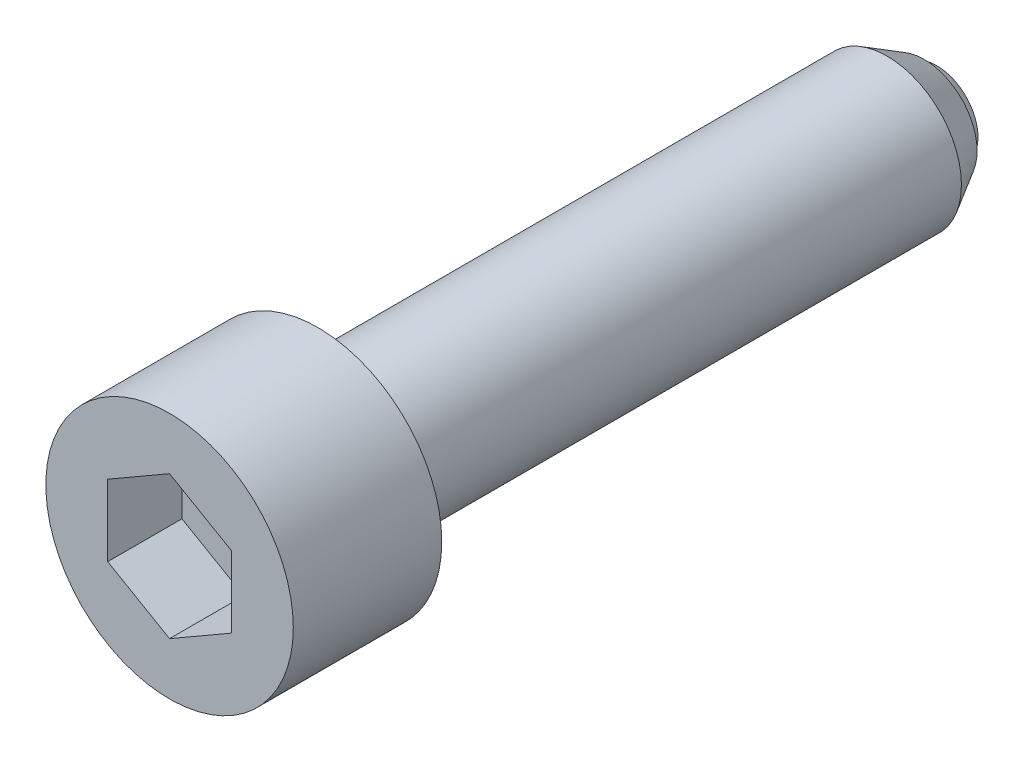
ISO-10303-21;
HEADER;
FILE_DESCRIPTION(('STEP AP214'),'2;1');
FILE_NAME('part.step','',(''),(''),'','','');
FILE_SCHEMA(('AUTOMOTIVE_DESIGN { 1 0 10303 214 1 1 1 1 }'));
ENDSEC;
DATA;
#1=APPLICATION_CONTEXT('core data for automotive mechanical design processes');
#2=APPLICATION_PROTOCOL_DEFINITION('international standard','automotive_design',2000,#1);
#3=PRODUCT_CONTEXT('',#1,'mechanical');
#4=PRODUCT('Part','Part','',(#3));
#5=PRODUCT_RELATED_PRODUCT_CATEGORY('part','',(#4));
#6=PRODUCT_DEFINITION_FORMATION('','',#4);
#7=PRODUCT_DEFINITION_CONTEXT('part definition',#1,'design');
#8=PRODUCT_DEFINITION('design','',#6,#7);
#9=PRODUCT_DEFINITION_SHAPE('','',#8);
#10=(LENGTH_UNIT() NAMED_UNIT(*) SI_UNIT(.MILLI.,.METRE.));
#11=(NAMED_UNIT(*) PLANE_ANGLE_UNIT() SI_UNIT($,.RADIAN.));
#12=(NAMED_UNIT(*) SI_UNIT($,.STERADIAN.) SOLID_ANGLE_UNIT());
#13=UNCERTAINTY_MEASURE_WITH_UNIT(LENGTH_MEASURE(1.E-05),#10,'distance_accuracy_value','');
#14=(GEOMETRIC_REPRESENTATION_CONTEXT(3) GLOBAL_UNCERTAINTY_ASSIGNED_CONTEXT((#13)) GLOBAL_UNIT_ASSIGNED_CONTEXT((#10,
#11,#12)) REPRESENTATION_CONTEXT('',''));
#15=CARTESIAN_POINT('',(0.,0.,0.));
#16=DIRECTION('',(0.,0.,1.));
#17=DIRECTION('',(1.,0.,0.));
#18=AXIS2_PLACEMENT_3D('',#15,#16,#17);
#19=CARTESIAN_POINT('',(0.,0.,1.1));
#20=DIRECTION('',(0.,0.,-1.));
#21=DIRECTION('',(1.,0.,0.));
#22=AXIS2_PLACEMENT_3D('',#19,#20,#21);
#23=SPHERICAL_SURFACE('',#22,2.);
#24=CARTESIAN_POINT('',(0.,0.,0.5));
#25=DIRECTION('',(0.,0.,-1.));
#26=DIRECTION('',(1.,0.,0.));
#27=AXIS2_PLACEMENT_3D('',#24,#25,#26);
#28=CIRCLE('',#27,1.90787840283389);
#29=CARTESIAN_POINT('',(1.90787840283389,0.,0.5));
#30=VERTEX_POINT('',#29);
#31=EDGE_CURVE('E9',#30,#30,#28,.T.);
#32=CARTESIAN_POINT('',(0.,0.,0.));
#33=DIRECTION('',(0.,0.,-1.));
#34=DIRECTION('',(1.,0.,0.));
#35=AXIS2_PLACEMENT_3D('',#32,#33,#34);
#36=CIRCLE('',#35,1.670329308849);
#37=CARTESIAN_POINT('',(1.67032930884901,0.,0.));
#38=VERTEX_POINT('',#37);
#39=EDGE_CURVE('E17',#38,#38,#36,.F.);
#40=CARTESIAN_POINT('',(1.90787840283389,0.,0.5));
#41=CARTESIAN_POINT('',(1.90614295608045,0.,0.494481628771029));
#42=CARTESIAN_POINT('',(1.90438356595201,0.,0.488970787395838));
#43=CARTESIAN_POINT('',(1.90081703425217,0.,0.477964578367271));
#44=CARTESIAN_POINT('',(1.89900989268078,0.,0.472469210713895));
#45=CARTESIAN_POINT('',(1.8953479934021,0.,0.46149436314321));
#46=CARTESIAN_POINT('',(1.89349323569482,0.,0.456014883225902));
#47=CARTESIAN_POINT('',(1.88973624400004,0.,0.445072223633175));
#48=CARTESIAN_POINT('',(1.88783401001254,0.,0.439609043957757));
#49=CARTESIAN_POINT('',(1.8839822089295,0.,0.428699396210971));
#50=CARTESIAN_POINT('',(1.88203264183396,0.,0.423252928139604));
#51=CARTESIAN_POINT('',(1.87808632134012,0.,0.412377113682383));
#52=CARTESIAN_POINT('',(1.87608956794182,0.,0.40694776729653));
#53=CARTESIAN_POINT('',(1.87204902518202,0.,0.396106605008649));
#54=CARTESIAN_POINT('',(1.87000523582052,0.,0.39069478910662));
#55=CARTESIAN_POINT('',(1.86587077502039,0.,0.379889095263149));
#56=CARTESIAN_POINT('',(1.86378010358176,0.,0.374495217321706));
#57=CARTESIAN_POINT('',(1.85955203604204,0.,0.363725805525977));
#58=CARTESIAN_POINT('',(1.85741463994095,0.,0.358350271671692));
#59=CARTESIAN_POINT('',(1.85309328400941,0.,0.347617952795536));
#60=CARTESIAN_POINT('',(1.85090932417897,0.,0.342261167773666));
#61=CARTESIAN_POINT('',(1.84649500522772,0.,0.331566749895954));
#62=CARTESIAN_POINT('',(1.84426464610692,0.,0.326229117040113));
#63=CARTESIAN_POINT('',(1.83975769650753,0.,0.315573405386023));
#64=CARTESIAN_POINT('',(1.83748110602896,0.,0.310255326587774));
#65=CARTESIAN_POINT('',(1.83288186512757,0.,0.299639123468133));
#66=CARTESIAN_POINT('',(1.83055921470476,0.,0.29434099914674));
#67=CARTESIAN_POINT('',(1.82586802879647,0.,0.283765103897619));
#68=CARTESIAN_POINT('',(1.823499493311,0.,0.278487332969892));
#69=CARTESIAN_POINT('',(1.81871671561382,0.,0.267952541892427));
#70=CARTESIAN_POINT('',(1.81630247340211,0.,0.26269552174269));
#71=CARTESIAN_POINT('',(1.81142846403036,0.,0.252202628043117));
#72=CARTESIAN_POINT('',(1.80896869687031,0.,0.246966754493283));
#73=CARTESIAN_POINT('',(1.80400382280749,0.,0.236516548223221));
#74=CARTESIAN_POINT('',(1.80149871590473,0.,0.231302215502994));
#75=CARTESIAN_POINT('',(1.79644335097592,0.,0.220895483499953));
#76=CARTESIAN_POINT('',(1.79389309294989,0.,0.215703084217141));
#77=CARTESIAN_POINT('',(1.78874761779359,0.,0.205340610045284));
#78=CARTESIAN_POINT('',(1.78615240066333,0.,0.200170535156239));
#79=CARTESIAN_POINT('',(1.78091720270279,0.,0.189853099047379));
#80=CARTESIAN_POINT('',(1.77827722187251,0.,0.184705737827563));
#81=CARTESIAN_POINT('',(1.77295269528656,0.,0.174434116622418));
#82=CARTESIAN_POINT('',(1.77026814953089,0.,0.169309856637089));
#83=CARTESIAN_POINT('',(1.76485469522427,0.,0.159084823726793));
#84=CARTESIAN_POINT('',(1.76212578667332,0.,0.153984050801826));
#85=CARTESIAN_POINT('',(1.7566238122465,0.,0.143806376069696));
#86=CARTESIAN_POINT('',(1.75385074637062,0.,0.138729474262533));
#87=CARTESIAN_POINT('',(1.7482606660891,0.,0.128599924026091));
#88=CARTESIAN_POINT('',(1.74544365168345,0.,0.123547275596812));
#89=CARTESIAN_POINT('',(1.73976588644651,0.,0.113466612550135));
#90=CARTESIAN_POINT('',(1.73690513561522,0.,0.108438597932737));
#91=CARTESIAN_POINT('',(1.73114011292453,0.,0.0984075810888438));
#92=CARTESIAN_POINT('',(1.72823584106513,0.,0.0934045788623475));
#93=CARTESIAN_POINT('',(1.72238399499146,0.,0.0834239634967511));
#94=CARTESIAN_POINT('',(1.71943642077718,0.,0.078446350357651));
#95=CARTESIAN_POINT('',(1.71349819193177,0.,0.0685168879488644));
#96=CARTESIAN_POINT('',(1.71050753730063,0.,0.0635650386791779));
#97=CARTESIAN_POINT('',(1.70448337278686,0.,0.0536874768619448));
#98=CARTESIAN_POINT('',(1.70144986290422,0.,0.0487617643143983));
#99=CARTESIAN_POINT('',(1.6953402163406,0.,0.0389368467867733));
#100=CARTESIAN_POINT('',(1.69226407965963,0.,0.034037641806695));
#101=CARTESIAN_POINT('',(1.68606941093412,0.,0.0242661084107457));
#102=CARTESIAN_POINT('',(1.68295087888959,0.,0.0193937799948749));
#103=CARTESIAN_POINT('',(1.67667165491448,0.,0.00967636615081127));
#104=CARTESIAN_POINT('',(1.67351096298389,0.,0.00483128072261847));
#105=CARTESIAN_POINT('',(1.67032930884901,0.,0.));
#106=B_SPLINE_CURVE_WITH_KNOTS('',3,(#40,#41,#42,#43,#44,#45,#46,#47,#48,#49,#50,#51,#52,#53,
#54,#55,#56,#57,#58,#59,#60,#61,#62,#63,#64,#65,#66,#67,#68,#69,#70,#71,#72,#73,#74,#75,#76,#77,
#78,#79,#80,#81,#82,#83,#84,#85,#86,#87,#88,#89,#90,#91,#92,#93,#94,#95,#96,#97,#98,#99,#100,
#101,#102,#103,#104,#105),.UNSPECIFIED.,.F.,.F.,(4,2,2,2,2,2,2,2,2,2,2,2,2,2,2,2,2,2,2,2,2,2,2,
2,2,2,2,2,2,2,2,2,4),(0.,0.0173544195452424,0.0347088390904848,0.0520632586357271,
0.0694176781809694,0.0867720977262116,0.104126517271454,0.121480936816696,0.138835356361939,
0.156189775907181,0.173544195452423,0.190898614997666,0.208253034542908,0.22560745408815,
0.242961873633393,0.260316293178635,0.277670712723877,0.295025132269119,0.312379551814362,
0.329733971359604,0.347088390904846,0.364442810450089,0.381797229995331,0.399151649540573,
0.416506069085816,0.433860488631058,0.4512149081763,0.468569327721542,0.485923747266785,
0.503278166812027,0.52063258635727,0.537987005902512,0.555341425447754),.UNSPECIFIED.);
#107=EDGE_CURVE('BSEAM14',#30,#38,#106,.T.);
#108=ORIENTED_EDGE('',*,*,#31,.T.);
#109=ORIENTED_EDGE('',*,*,#39,.T.);
#110=ORIENTED_EDGE('',*,*,#107,.T.);
#111=ORIENTED_EDGE('',*,*,#107,.F.);
#112=EDGE_LOOP('',(#108,#110,#109,#111));
#113=FACE_BOUND('',#112,.T.);
#114=ADVANCED_FACE('F14',(#113),#23,.T.);
#115=CARTESIAN_POINT('',(2.13397459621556,0.,0.5));
#116=DIRECTION('',(0.,0.,1.));
#117=DIRECTION('',(-1.,0.,0.));
#118=AXIS2_PLACEMENT_3D('',#115,#116,#117);
#119=PLANE('',#118);
#120=ORIENTED_EDGE('',*,*,#31,.F.);
#121=EDGE_LOOP('',(#120));
#122=FACE_BOUND('',#121,.T.);
#123=CARTESIAN_POINT('',(0.,0.,0.5));
#124=DIRECTION('',(0.,0.,-1.));
#125=DIRECTION('',(1.,0.,0.));
#126=AXIS2_PLACEMENT_3D('',#123,#124,#125);
#127=CIRCLE('',#126,2.13397459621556);
#128=CARTESIAN_POINT('',(2.13397459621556,0.,0.5));
#129=VERTEX_POINT('',#128);
#130=EDGE_CURVE('E22',#129,#129,#127,.T.);
#131=ORIENTED_EDGE('',*,*,#130,.T.);
#132=EDGE_LOOP('',(#131));
#133=FACE_BOUND('',#132,.T.);
#134=ADVANCED_FACE('F137',(#122,#133),#119,.F.);
#135=CARTESIAN_POINT('',(0.,0.,2.));
#136=DIRECTION('',(0.,0.,1.));
#137=DIRECTION('',(-1.,0.,0.));
#138=AXIS2_PLACEMENT_3D('',#135,#136,#137);
#139=CONICAL_SURFACE('',#138,3.,0.523598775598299);
#140=ORIENTED_EDGE('',*,*,#130,.F.);
#141=EDGE_LOOP('',(#140));
#142=FACE_BOUND('',#141,.T.);
#143=CARTESIAN_POINT('',(0.,0.,2.));
#144=DIRECTION('',(0.,0.,-1.));
#145=DIRECTION('',(1.,0.,0.));
#146=AXIS2_PLACEMENT_3D('',#143,#144,#145);
#147=CIRCLE('',#146,3.);
#148=CARTESIAN_POINT('',(3.,0.,2.));
#149=VERTEX_POINT('',#148);
#150=EDGE_CURVE('E131',#149,#149,#147,.T.);
#151=ORIENTED_EDGE('',*,*,#150,.T.);
#152=EDGE_LOOP('',(#151));
#153=FACE_BOUND('',#152,.T.);
#154=ADVANCED_FACE('F139',(#142,#153),#139,.T.);
#155=CARTESIAN_POINT('',(0.,0.,5.));
#156=DIRECTION('',(0.,0.,-1.));
#157=DIRECTION('',(1.,0.,0.));
#158=AXIS2_PLACEMENT_3D('',#155,#156,#157);
#159=CYLINDRICAL_SURFACE('',#158,3.);
#160=ORIENTED_EDGE('',*,*,#150,.F.);
#161=EDGE_LOOP('',(#160));
#162=FACE_BOUND('',#161,.T.);
#163=CARTESIAN_POINT('',(0.,0.,25.));
#164=DIRECTION('',(0.,0.,-1.));
#165=DIRECTION('',(1.,0.,0.));
#166=AXIS2_PLACEMENT_3D('',#163,#164,#165);
#167=CIRCLE('',#166,3.);
#168=CARTESIAN_POINT('',(3.,0.,25.));
#169=VERTEX_POINT('',#168);
#170=EDGE_CURVE('E128',#169,#169,#167,.T.);
#171=ORIENTED_EDGE('',*,*,#170,.T.);
#172=EDGE_LOOP('',(#171));
#173=FACE_BOUND('',#172,.T.);
#174=ADVANCED_FACE('F142',(#162,#173),#159,.T.);
#175=CARTESIAN_POINT('',(3.,0.,25.));
#176=DIRECTION('',(0.,0.,-1.));
#177=DIRECTION('',(1.,0.,0.));
#178=AXIS2_PLACEMENT_3D('',#175,#176,#177);
#179=PLANE('',#178);
#180=CARTESIAN_POINT('',(0.,0.,25.));
#181=DIRECTION('',(0.,0.,-1.));
#182=DIRECTION('',(1.,0.,0.));
#183=AXIS2_PLACEMENT_3D('',#180,#181,#182);
#184=CIRCLE('',#183,5.);
#185=CARTESIAN_POINT('',(5.,0.,25.));
#186=VERTEX_POINT('',#185);
#187=EDGE_CURVE('E125',#186,#186,#184,.T.);
#188=ORIENTED_EDGE('',*,*,#187,.T.);
#189=EDGE_LOOP('',(#188));
#190=FACE_BOUND('',#189,.T.);
#191=ORIENTED_EDGE('',*,*,#170,.F.);
#192=EDGE_LOOP('',(#191));
#193=FACE_BOUND('',#192,.T.);
#194=ADVANCED_FACE('F148',(#190,#193),#179,.T.);
#195=CARTESIAN_POINT('',(0.,0.,5.));
#196=DIRECTION('',(0.,0.,-1.));
#197=DIRECTION('',(1.,0.,0.));
#198=AXIS2_PLACEMENT_3D('',#195,#196,#197);
#199=CYLINDRICAL_SURFACE('',#198,5.);
#200=CARTESIAN_POINT('',(0.,0.,31.));
#201=DIRECTION('',(0.,0.,-1.));
#202=DIRECTION('',(1.,0.,0.));
#203=AXIS2_PLACEMENT_3D('',#200,#201,#202);
#204=CIRCLE('',#203,5.);
#205=CARTESIAN_POINT('',(5.,0.,31.));
#206=VERTEX_POINT('',#205);
#207=EDGE_CURVE('E122',#206,#206,#204,.T.);
#208=ORIENTED_EDGE('',*,*,#207,.T.);
#209=EDGE_LOOP('',(#208));
#210=FACE_BOUND('',#209,.T.);
#211=ORIENTED_EDGE('',*,*,#187,.F.);
#212=EDGE_LOOP('',(#211));
#213=FACE_BOUND('',#212,.T.);
#214=ADVANCED_FACE('F153',(#210,#213),#199,.T.);
#215=CARTESIAN_POINT('',(5.,0.,31.));
#216=DIRECTION('',(0.,0.,1.));
#217=DIRECTION('',(-1.,0.,0.));
#218=AXIS2_PLACEMENT_3D('',#215,#216,#217);
#219=PLANE('',#218);
#220=DIRECTION('',(-0.86602540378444,0.5,0.));
#221=VECTOR('',#220,1.);
#222=CARTESIAN_POINT('',(2.5,1.44337567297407,31.));
#223=LINE('',#222,#221);
#224=CARTESIAN_POINT('',(2.5,1.44337567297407,31.));
#225=VERTEX_POINT('',#224);
#226=CARTESIAN_POINT('',(0.,2.88675134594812,31.));
#227=VERTEX_POINT('',#226);
#228=EDGE_CURVE('E29',#225,#227,#223,.T.);
#229=ORIENTED_EDGE('',*,*,#228,.F.);
#230=DIRECTION('',(0.,1.,0.));
#231=VECTOR('',#230,1.);
#232=CARTESIAN_POINT('',(2.5,-1.44337567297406,31.));
#233=LINE('',#232,#231);
#234=CARTESIAN_POINT('',(2.5,-1.44337567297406,31.));
#235=VERTEX_POINT('',#234);
#236=EDGE_CURVE('E98',#235,#225,#233,.T.);
#237=ORIENTED_EDGE('',*,*,#236,.F.);
#238=DIRECTION('',(-0.866025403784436,-0.5,0.));
#239=VECTOR('',#238,1.);
#240=CARTESIAN_POINT('',(2.5,-1.44337567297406,31.));
#241=LINE('',#240,#239);
#242=CARTESIAN_POINT('',(0.,-2.88675134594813,31.));
#243=VERTEX_POINT('',#242);
#244=EDGE_CURVE('E93',#235,#243,#241,.T.);
#245=ORIENTED_EDGE('',*,*,#244,.T.);
#246=DIRECTION('',(0.866025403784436,-0.5,0.));
#247=VECTOR('',#246,1.);
#248=CARTESIAN_POINT('',(-2.5,-1.44337567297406,31.));
#249=LINE('',#248,#247);
#250=CARTESIAN_POINT('',(-2.5,-1.44337567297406,31.));
#251=VERTEX_POINT('',#250);
#252=EDGE_CURVE('E91',#251,#243,#249,.T.);
#253=ORIENTED_EDGE('',*,*,#252,.F.);
#254=DIRECTION('',(0.,1.,0.));
#255=VECTOR('',#254,1.);
#256=CARTESIAN_POINT('',(-2.5,-1.44337567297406,31.));
#257=LINE('',#256,#255);
#258=CARTESIAN_POINT('',(-2.5,1.44337567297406,31.));
#259=VERTEX_POINT('',#258);
#260=EDGE_CURVE('E72',#251,#259,#257,.T.);
#261=ORIENTED_EDGE('',*,*,#260,.T.);
#262=DIRECTION('',(0.866025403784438,0.5,0.));
#263=VECTOR('',#262,1.);
#264=CARTESIAN_POINT('',(-2.5,1.44337567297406,31.));
#265=LINE('',#264,#263);
#266=EDGE_CURVE('E83',#259,#227,#265,.T.);
#267=ORIENTED_EDGE('',*,*,#266,.T.);
#268=EDGE_LOOP('',(#229,#237,#245,#253,#261,#267));
#269=FACE_BOUND('',#268,.T.);
#270=ORIENTED_EDGE('',*,*,#207,.F.);
#271=EDGE_LOOP('',(#270));
#272=FACE_BOUND('',#271,.T.);
#273=ADVANCED_FACE('F87',(#269,#272),#219,.T.);
#274=CARTESIAN_POINT('',(2.5,1.44337567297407,28.));
#275=DIRECTION('',(0.5,0.86602540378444,0.));
#276=DIRECTION('',(0.86602540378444,-0.5,0.));
#277=AXIS2_PLACEMENT_3D('',#274,#275,#276);
#278=PLANE('',#277);
#279=DIRECTION('',(0.,0.,1.));
#280=VECTOR('',#279,1.);
#281=CARTESIAN_POINT('',(2.5,1.44337567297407,28.));
#282=LINE('',#281,#280);
#283=CARTESIAN_POINT('',(2.5,1.44337567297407,28.));
#284=VERTEX_POINT('',#283);
#285=EDGE_CURVE('E36',#284,#225,#282,.T.);
#286=ORIENTED_EDGE('',*,*,#285,.T.);
#287=ORIENTED_EDGE('',*,*,#228,.T.);
#288=DIRECTION('',(0.,0.,1.));
#289=VECTOR('',#288,1.);
#290=CARTESIAN_POINT('',(0.,2.88675134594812,28.));
#291=LINE('',#290,#289);
#292=CARTESIAN_POINT('',(0.,2.88675134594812,28.));
#293=VERTEX_POINT('',#292);
#294=EDGE_CURVE('E80',#293,#227,#291,.T.);
#295=ORIENTED_EDGE('',*,*,#294,.F.);
#296=DIRECTION('',(-0.86602540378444,0.5,0.));
#297=VECTOR('',#296,1.);
#298=CARTESIAN_POINT('',(2.5,1.44337567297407,28.));
#299=LINE('',#298,#297);
#300=EDGE_CURVE('E100',#284,#293,#299,.T.);
#301=ORIENTED_EDGE('',*,*,#300,.F.);
#302=EDGE_LOOP('',(#286,#287,#295,#301));
#303=FACE_BOUND('',#302,.T.);
#304=ADVANCED_FACE('F190',(#303),#278,.F.);
#305=CARTESIAN_POINT('',(2.5,-1.44337567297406,28.));
#306=DIRECTION('',(1.,0.,0.));
#307=DIRECTION('',(0.,0.,1.));
#308=AXIS2_PLACEMENT_3D('',#305,#306,#307);
#309=PLANE('',#308);
#310=DIRECTION('',(0.,0.,1.));
#311=VECTOR('',#310,1.);
#312=CARTESIAN_POINT('',(2.5,-1.44337567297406,28.));
#313=LINE('',#312,#311);
#314=CARTESIAN_POINT('',(2.5,-1.44337567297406,28.));
#315=VERTEX_POINT('',#314);
#316=EDGE_CURVE('E119',#315,#235,#313,.T.);
#317=ORIENTED_EDGE('',*,*,#316,.T.);
#318=ORIENTED_EDGE('',*,*,#236,.T.);
#319=ORIENTED_EDGE('',*,*,#285,.F.);
#320=DIRECTION('',(0.,1.,0.));
#321=VECTOR('',#320,1.);
#322=CARTESIAN_POINT('',(2.5,-1.44337567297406,28.));
#323=LINE('',#322,#321);
#324=EDGE_CURVE('E112',#315,#284,#323,.T.);
#325=ORIENTED_EDGE('',*,*,#324,.F.);
#326=EDGE_LOOP('',(#317,#318,#319,#325));
#327=FACE_BOUND('',#326,.T.);
#328=ADVANCED_FACE('F198',(#327),#309,.F.);
#329=CARTESIAN_POINT('',(2.5,-1.44337567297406,28.));
#330=DIRECTION('',(-0.5,0.866025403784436,0.));
#331=DIRECTION('',(0.866025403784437,0.5,0.));
#332=AXIS2_PLACEMENT_3D('',#329,#330,#331);
#333=PLANE('',#332);
#334=DIRECTION('',(0.,0.,1.));
#335=VECTOR('',#334,1.);
#336=CARTESIAN_POINT('',(0.,-2.88675134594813,28.));
#337=LINE('',#336,#335);
#338=CARTESIAN_POINT('',(0.,-2.88675134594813,28.));
#339=VERTEX_POINT('',#338);
#340=EDGE_CURVE('E117',#339,#243,#337,.T.);
#341=ORIENTED_EDGE('',*,*,#340,.T.);
#342=ORIENTED_EDGE('',*,*,#244,.F.);
#343=ORIENTED_EDGE('',*,*,#316,.F.);
#344=DIRECTION('',(-0.866025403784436,-0.5,0.));
#345=VECTOR('',#344,1.);
#346=CARTESIAN_POINT('',(2.5,-1.44337567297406,28.));
#347=LINE('',#346,#345);
#348=EDGE_CURVE('E109',#315,#339,#347,.T.);
#349=ORIENTED_EDGE('',*,*,#348,.T.);
#350=EDGE_LOOP('',(#341,#342,#343,#349));
#351=FACE_BOUND('',#350,.T.);
#352=ADVANCED_FACE('F194',(#351),#333,.T.);
#353=CARTESIAN_POINT('',(-2.5,-1.44337567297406,28.));
#354=DIRECTION('',(-0.5,-0.866025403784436,0.));
#355=DIRECTION('',(-0.866025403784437,0.5,0.));
#356=AXIS2_PLACEMENT_3D('',#353,#354,#355);
#357=PLANE('',#356);
#358=DIRECTION('',(0.,0.,1.));
#359=VECTOR('',#358,1.);
#360=CARTESIAN_POINT('',(-2.5,-1.44337567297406,28.));
#361=LINE('',#360,#359);
#362=CARTESIAN_POINT('',(-2.5,-1.44337567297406,28.));
#363=VERTEX_POINT('',#362);
#364=EDGE_CURVE('E79',#363,#251,#361,.T.);
#365=ORIENTED_EDGE('',*,*,#364,.T.);
#366=ORIENTED_EDGE('',*,*,#252,.T.);
#367=ORIENTED_EDGE('',*,*,#340,.F.);
#368=DIRECTION('',(0.866025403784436,-0.5,0.));
#369=VECTOR('',#368,1.);
#370=CARTESIAN_POINT('',(-2.5,-1.44337567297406,28.));
#371=LINE('',#370,#369);
#372=EDGE_CURVE('E106',#363,#339,#371,.T.);
#373=ORIENTED_EDGE('',*,*,#372,.F.);
#374=EDGE_LOOP('',(#365,#366,#367,#373));
#375=FACE_BOUND('',#374,.T.);
#376=ADVANCED_FACE('F187',(#375),#357,.F.);
#377=CARTESIAN_POINT('',(-2.5,-1.44337567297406,28.));
#378=DIRECTION('',(1.,0.,0.));
#379=DIRECTION('',(0.,-1.,0.));
#380=AXIS2_PLACEMENT_3D('',#377,#378,#379);
#381=PLANE('',#380);
#382=DIRECTION('',(0.,0.,1.));
#383=VECTOR('',#382,1.);
#384=CARTESIAN_POINT('',(-2.5,1.44337567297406,28.));
#385=LINE('',#384,#383);
#386=CARTESIAN_POINT('',(-2.5,1.44337567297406,28.));
#387=VERTEX_POINT('',#386);
#388=EDGE_CURVE('E68',#387,#259,#385,.T.);
#389=ORIENTED_EDGE('',*,*,#388,.T.);
#390=ORIENTED_EDGE('',*,*,#260,.F.);
#391=ORIENTED_EDGE('',*,*,#364,.F.);
#392=DIRECTION('',(0.,1.,0.));
#393=VECTOR('',#392,1.);
#394=CARTESIAN_POINT('',(-2.5,-1.44337567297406,28.));
#395=LINE('',#394,#393);
#396=EDGE_CURVE('E75',#363,#387,#395,.T.);
#397=ORIENTED_EDGE('',*,*,#396,.T.);
#398=EDGE_LOOP('',(#389,#390,#391,#397));
#399=FACE_BOUND('',#398,.T.);
#400=ADVANCED_FACE('F70',(#399),#381,.T.);
#401=CARTESIAN_POINT('',(-2.5,1.44337567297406,28.));
#402=DIRECTION('',(0.5,-0.866025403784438,0.));
#403=DIRECTION('',(-0.866025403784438,-0.5,0.));
#404=AXIS2_PLACEMENT_3D('',#401,#402,#403);
#405=PLANE('',#404);
#406=DIRECTION('',(0.866025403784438,0.5,0.));
#407=VECTOR('',#406,1.);
#408=CARTESIAN_POINT('',(-2.5,1.44337567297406,28.));
#409=LINE('',#408,#407);
#410=EDGE_CURVE('E103',#387,#293,#409,.T.);
#411=ORIENTED_EDGE('',*,*,#410,.T.);
#412=ORIENTED_EDGE('',*,*,#294,.T.);
#413=ORIENTED_EDGE('',*,*,#266,.F.);
#414=ORIENTED_EDGE('',*,*,#388,.F.);
#415=EDGE_LOOP('',(#411,#412,#413,#414));
#416=FACE_BOUND('',#415,.T.);
#417=ADVANCED_FACE('F84',(#416),#405,.T.);
#418=CARTESIAN_POINT('',(2.5,1.44337567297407,28.));
#419=DIRECTION('',(0.,0.,-1.));
#420=DIRECTION('',(1.,0.,0.));
#421=AXIS2_PLACEMENT_3D('',#418,#419,#420);
#422=PLANE('',#421);
#423=ORIENTED_EDGE('',*,*,#300,.T.);
#424=ORIENTED_EDGE('',*,*,#410,.F.);
#425=ORIENTED_EDGE('',*,*,#396,.F.);
#426=ORIENTED_EDGE('',*,*,#372,.T.);
#427=ORIENTED_EDGE('',*,*,#348,.F.);
#428=ORIENTED_EDGE('',*,*,#324,.T.);
#429=EDGE_LOOP('',(#423,#424,#425,#426,#427,#428));
#430=FACE_BOUND('',#429,.T.);
#431=ADVANCED_FACE('F175',(#430),#422,.F.);
#432=CARTESIAN_POINT('',(0.,0.,0.));
#433=DIRECTION('',(0.,0.,-1.));
#434=DIRECTION('',(1.,0.,0.));
#435=AXIS2_PLACEMENT_3D('',#432,#433,#434);
#436=PLANE('',#435);
#437=ORIENTED_EDGE('',*,*,#39,.F.);
#438=EDGE_LOOP('',(#437));
#439=FACE_BOUND('',#438,.T.);
#440=ADVANCED_FACE('F173',(#439),#436,.T.);
#441=CLOSED_SHELL('',(#114,#134,#154,#174,#194,#214,#273,#304,#328,#352,#376,#400,#417,#431,#440));
#442=MANIFOLD_SOLID_BREP('B1',#441);
#443=ADVANCED_BREP_SHAPE_REPRESENTATION('',(#18,#442),#14);
#444=SHAPE_DEFINITION_REPRESENTATION(#9,#443);
ENDSEC;
END-ISO-10303-21;
